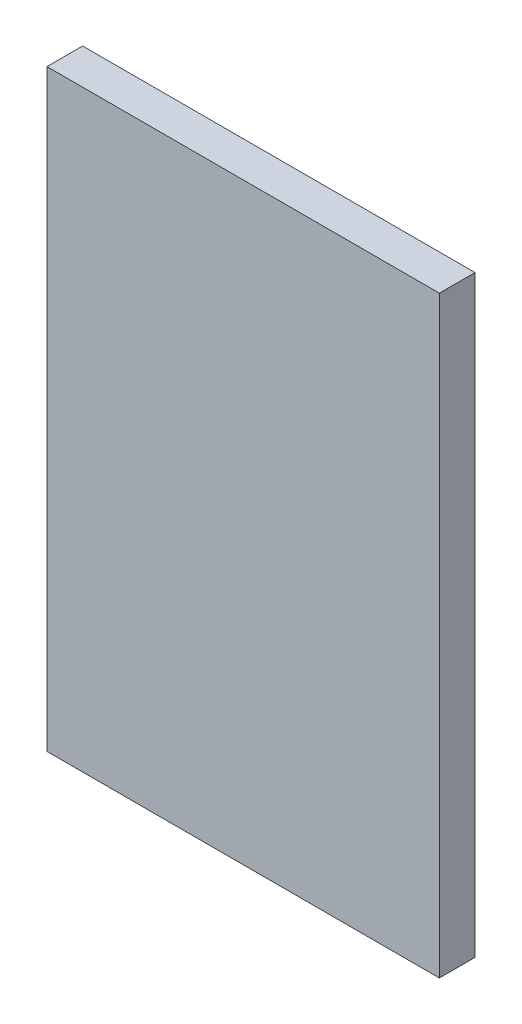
ISO-10303-21;
HEADER;
FILE_DESCRIPTION(('STEP AP214'),'2;1');
FILE_NAME('part.step','',(''),(''),'','','');
FILE_SCHEMA(('AUTOMOTIVE_DESIGN { 1 0 10303 214 1 1 1 1 }'));
ENDSEC;
DATA;
#1=APPLICATION_CONTEXT('core data for automotive mechanical design processes');
#2=APPLICATION_PROTOCOL_DEFINITION('international standard','automotive_design',2000,#1);
#3=PRODUCT_CONTEXT('',#1,'mechanical');
#4=PRODUCT('Part','Part','',(#3));
#5=PRODUCT_RELATED_PRODUCT_CATEGORY('part','',(#4));
#6=PRODUCT_DEFINITION_FORMATION('','',#4);
#7=PRODUCT_DEFINITION_CONTEXT('part definition',#1,'design');
#8=PRODUCT_DEFINITION('design','',#6,#7);
#9=PRODUCT_DEFINITION_SHAPE('','',#8);
#10=(LENGTH_UNIT() NAMED_UNIT(*) SI_UNIT(.MILLI.,.METRE.));
#11=(NAMED_UNIT(*) PLANE_ANGLE_UNIT() SI_UNIT($,.RADIAN.));
#12=(NAMED_UNIT(*) SI_UNIT($,.STERADIAN.) SOLID_ANGLE_UNIT());
#13=UNCERTAINTY_MEASURE_WITH_UNIT(LENGTH_MEASURE(1.E-05),#10,'distance_accuracy_value','');
#14=(GEOMETRIC_REPRESENTATION_CONTEXT(3) GLOBAL_UNCERTAINTY_ASSIGNED_CONTEXT((#13)) GLOBAL_UNIT_ASSIGNED_CONTEXT((#10,
#11,#12)) REPRESENTATION_CONTEXT('',''));
#15=CARTESIAN_POINT('',(0.,0.,0.));
#16=DIRECTION('',(0.,0.,1.));
#17=DIRECTION('',(1.,0.,0.));
#18=AXIS2_PLACEMENT_3D('',#15,#16,#17);
#19=CARTESIAN_POINT('',(88.,133.,16.));
#20=DIRECTION('',(-1.,0.,0.));
#21=DIRECTION('',(0.,-1.,0.));
#22=AXIS2_PLACEMENT_3D('',#19,#20,#21);
#23=PLANE('',#22);
#24=DIRECTION('',(0.,1.,0.));
#25=VECTOR('',#24,1.);
#26=CARTESIAN_POINT('',(88.,133.,0.));
#27=LINE('',#26,#25);
#28=CARTESIAN_POINT('',(88.,-133.,0.));
#29=VERTEX_POINT('',#28);
#30=CARTESIAN_POINT('',(88.,133.,0.));
#31=VERTEX_POINT('',#30);
#32=EDGE_CURVE('E94',#29,#31,#27,.T.);
#33=ORIENTED_EDGE('',*,*,#32,.T.);
#34=DIRECTION('',(0.,0.,-1.));
#35=VECTOR('',#34,1.);
#36=CARTESIAN_POINT('',(88.,133.,16.));
#37=LINE('',#36,#35);
#38=CARTESIAN_POINT('',(88.,133.,16.));
#39=VERTEX_POINT('',#38);
#40=EDGE_CURVE('E11',#39,#31,#37,.T.);
#41=ORIENTED_EDGE('',*,*,#40,.F.);
#42=DIRECTION('',(0.,1.,0.));
#43=VECTOR('',#42,1.);
#44=CARTESIAN_POINT('',(88.,133.,16.));
#45=LINE('',#44,#43);
#46=CARTESIAN_POINT('',(88.,-133.,16.));
#47=VERTEX_POINT('',#46);
#48=EDGE_CURVE('E82',#47,#39,#45,.T.);
#49=ORIENTED_EDGE('',*,*,#48,.F.);
#50=DIRECTION('',(0.,0.,-1.));
#51=VECTOR('',#50,1.);
#52=CARTESIAN_POINT('',(88.,-133.,16.));
#53=LINE('',#52,#51);
#54=EDGE_CURVE('E90',#47,#29,#53,.T.);
#55=ORIENTED_EDGE('',*,*,#54,.T.);
#56=EDGE_LOOP('',(#33,#41,#49,#55));
#57=FACE_BOUND('',#56,.T.);
#58=ADVANCED_FACE('F31',(#57),#23,.F.);
#59=CARTESIAN_POINT('',(-88.,133.,16.));
#60=DIRECTION('',(0.,-1.,0.));
#61=DIRECTION('',(0.,0.,-1.));
#62=AXIS2_PLACEMENT_3D('',#59,#60,#61);
#63=PLANE('',#62);
#64=DIRECTION('',(-1.,0.,0.));
#65=VECTOR('',#64,1.);
#66=CARTESIAN_POINT('',(-88.,133.,0.));
#67=LINE('',#66,#65);
#68=CARTESIAN_POINT('',(-88.,133.,0.));
#69=VERTEX_POINT('',#68);
#70=EDGE_CURVE('E86',#31,#69,#67,.T.);
#71=ORIENTED_EDGE('',*,*,#70,.T.);
#72=DIRECTION('',(0.,0.,-1.));
#73=VECTOR('',#72,1.);
#74=CARTESIAN_POINT('',(-88.,133.,16.));
#75=LINE('',#74,#73);
#76=CARTESIAN_POINT('',(-88.,133.,16.));
#77=VERTEX_POINT('',#76);
#78=EDGE_CURVE('E39',#77,#69,#75,.T.);
#79=ORIENTED_EDGE('',*,*,#78,.F.);
#80=DIRECTION('',(-1.,0.,0.));
#81=VECTOR('',#80,1.);
#82=CARTESIAN_POINT('',(-88.,133.,16.));
#83=LINE('',#82,#81);
#84=EDGE_CURVE('E77',#39,#77,#83,.T.);
#85=ORIENTED_EDGE('',*,*,#84,.F.);
#86=ORIENTED_EDGE('',*,*,#40,.T.);
#87=EDGE_LOOP('',(#71,#79,#85,#86));
#88=FACE_BOUND('',#87,.T.);
#89=ADVANCED_FACE('F85',(#88),#63,.F.);
#90=CARTESIAN_POINT('',(-88.,133.,16.));
#91=DIRECTION('',(1.,0.,0.));
#92=DIRECTION('',(0.,1.,0.));
#93=AXIS2_PLACEMENT_3D('',#90,#91,#92);
#94=PLANE('',#93);
#95=DIRECTION('',(0.,-1.,0.));
#96=VECTOR('',#95,1.);
#97=CARTESIAN_POINT('',(-88.,133.,0.));
#98=LINE('',#97,#96);
#99=CARTESIAN_POINT('',(-88.,-133.,0.));
#100=VERTEX_POINT('',#99);
#101=EDGE_CURVE('E64',#69,#100,#98,.T.);
#102=ORIENTED_EDGE('',*,*,#101,.T.);
#103=DIRECTION('',(0.,0.,-1.));
#104=VECTOR('',#103,1.);
#105=CARTESIAN_POINT('',(-88.,-133.,16.));
#106=LINE('',#105,#104);
#107=CARTESIAN_POINT('',(-88.,-133.,16.));
#108=VERTEX_POINT('',#107);
#109=EDGE_CURVE('E87',#108,#100,#106,.T.);
#110=ORIENTED_EDGE('',*,*,#109,.F.);
#111=DIRECTION('',(0.,-1.,0.));
#112=VECTOR('',#111,1.);
#113=CARTESIAN_POINT('',(-88.,133.,16.));
#114=LINE('',#113,#112);
#115=EDGE_CURVE('E80',#77,#108,#114,.T.);
#116=ORIENTED_EDGE('',*,*,#115,.F.);
#117=ORIENTED_EDGE('',*,*,#78,.T.);
#118=EDGE_LOOP('',(#102,#110,#116,#117));
#119=FACE_BOUND('',#118,.T.);
#120=ADVANCED_FACE('F88',(#119),#94,.F.);
#121=CARTESIAN_POINT('',(-88.,-133.,16.));
#122=DIRECTION('',(0.,1.,0.));
#123=DIRECTION('',(0.,0.,1.));
#124=AXIS2_PLACEMENT_3D('',#121,#122,#123);
#125=PLANE('',#124);
#126=DIRECTION('',(1.,0.,0.));
#127=VECTOR('',#126,1.);
#128=CARTESIAN_POINT('',(-88.,-133.,0.));
#129=LINE('',#128,#127);
#130=EDGE_CURVE('E70',#100,#29,#129,.T.);
#131=ORIENTED_EDGE('',*,*,#130,.T.);
#132=ORIENTED_EDGE('',*,*,#54,.F.);
#133=DIRECTION('',(1.,0.,0.));
#134=VECTOR('',#133,1.);
#135=CARTESIAN_POINT('',(-88.,-133.,16.));
#136=LINE('',#135,#134);
#137=EDGE_CURVE('E47',#108,#47,#136,.T.);
#138=ORIENTED_EDGE('',*,*,#137,.F.);
#139=ORIENTED_EDGE('',*,*,#109,.T.);
#140=EDGE_LOOP('',(#131,#132,#138,#139));
#141=FACE_BOUND('',#140,.T.);
#142=ADVANCED_FACE('F101',(#141),#125,.F.);
#143=CARTESIAN_POINT('',(88.,-133.,16.));
#144=DIRECTION('',(0.,0.,1.));
#145=DIRECTION('',(1.,0.,0.));
#146=AXIS2_PLACEMENT_3D('',#143,#144,#145);
#147=PLANE('',#146);
#148=ORIENTED_EDGE('',*,*,#48,.T.);
#149=ORIENTED_EDGE('',*,*,#84,.T.);
#150=ORIENTED_EDGE('',*,*,#115,.T.);
#151=ORIENTED_EDGE('',*,*,#137,.T.);
#152=EDGE_LOOP('',(#148,#149,#150,#151));
#153=FACE_BOUND('',#152,.T.);
#154=ADVANCED_FACE('F78',(#153),#147,.T.);
#155=CARTESIAN_POINT('',(88.,-133.,0.));
#156=DIRECTION('',(0.,0.,1.));
#157=DIRECTION('',(1.,0.,0.));
#158=AXIS2_PLACEMENT_3D('',#155,#156,#157);
#159=PLANE('',#158);
#160=ORIENTED_EDGE('',*,*,#32,.F.);
#161=ORIENTED_EDGE('',*,*,#130,.F.);
#162=ORIENTED_EDGE('',*,*,#101,.F.);
#163=ORIENTED_EDGE('',*,*,#70,.F.);
#164=EDGE_LOOP('',(#160,#161,#162,#163));
#165=FACE_BOUND('',#164,.T.);
#166=ADVANCED_FACE('F104',(#165),#159,.F.);
#167=CLOSED_SHELL('',(#58,#89,#120,#142,#154,#166));
#168=MANIFOLD_SOLID_BREP('B2',#167);
#169=ADVANCED_BREP_SHAPE_REPRESENTATION('',(#18,#168),#14);
#170=SHAPE_DEFINITION_REPRESENTATION(#9,#169);
ENDSEC;
END-ISO-10303-21;
